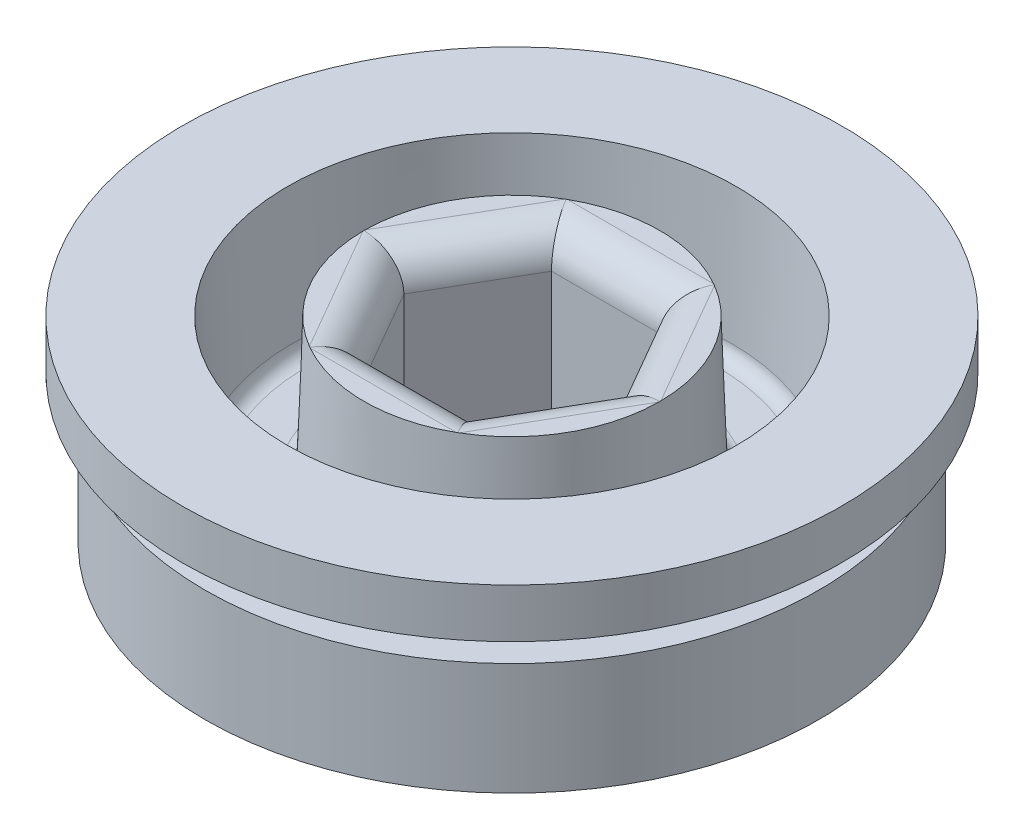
from build123d import *

# Parameters (mm, degrees)
BLANK_BEFORE_THREAD_DEPTH      = 1.778
BLANK_BEFORE_THREAD_DEPTH_BACK = 5.334
SKETCH1_R                      = 11.1125
SKETCH4_R                      = 11.938
HEAD_DEPTH                     = 1.778
RECESS_START                   = -1.27
SKETCH5_R                      = 11.938
SKETCH5_R_2                    = 10.1346
RECESS_UNDER_HEAD_DEPTH        = 1.27
FILL_START                     = 1.27
SKETCH8_R                      = 10.1346
FILL_IN_RECESS_DEPTH           = 1.27
HEX_THRU_DEPTH                 = 19.319722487
FILLET_ON_HEX_R                = 1.27
SKETCH7_R                      = 8.128
SKETCH7_R_2                    = 5.3594
SPRING_RECESS_DEPTH            = 5.334
SPRING_RECESS_DRAFT            = -2
FILLET1_R                      = 0.508


with BuildPart() as part:
    # Sketch1 → Blank Before Thread (new, two sides: drawn at the far end of the back side and taken through both)
    with BuildSketch(Plane(origin=(0, 0, 0), x_dir=(1, 0, 0), z_dir=(0, 1, 0)).offset(-BLANK_BEFORE_THREAD_DEPTH_BACK)):
        with Locations(Location((0, 0, 0), (0, 0, 270))):
            Circle(SKETCH1_R)
    extrude(amount=BLANK_BEFORE_THREAD_DEPTH + BLANK_BEFORE_THREAD_DEPTH_BACK)

    # Sketch4 → Head (add)
    with BuildSketch(Plane(origin=(0, 0, 0), x_dir=(1, 0, 0), z_dir=(0, 1, 0))):
        with Locations(Location((0, 0, 0), (0, 0, 270))):
            Circle(SKETCH4_R)
    extrude(amount=HEAD_DEPTH)

    # Sketch5 → Recess Under Head (cut)
    with BuildSketch(Plane(origin=(0, 0, 0), x_dir=(1, 0, 0), z_dir=(0, 1, 0)).offset(RECESS_START)):
        with Locations(Location((0, 0, 0), (0, 0, 270))):
            Circle(SKETCH5_R)
        with Locations(Location((0, 0, 0), (0, 0, 270))):
            Circle(SKETCH5_R_2, mode=Mode.SUBTRACT)
    extrude(amount=RECESS_UNDER_HEAD_DEPTH, mode=Mode.SUBTRACT)

    # Sketch8 → Fill in Recess (add)
    with BuildSketch(Plane.XZ.offset(FILL_START)):
        with Locations(Location((0, 0, 0), (0, 0, 90))):
            Circle(SKETCH8_R)
    extrude(amount=-FILL_IN_RECESS_DEPTH)

    # Sketch6 → Hex Thru (cut, through all)
    with BuildSketch(Plane(origin=(0, 1.778, 0), x_dir=(-1, 0, 0), z_dir=(0, 1, 0))):
        Polygon((1.957737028, -3.3909), (-1.957737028, -3.3909), (-3.915474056, 0), (-1.957737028, 3.3909), (1.957737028, 3.3909), (3.915474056, 0), align=None)
    extrude(amount=-HEX_THRU_DEPTH, mode=Mode.SUBTRACT)

    # Fillet on Hex
    fillet_on_hex_edges = [part.edges().sort_by_distance(p)[0] for p in [
        (2.936605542, 1.778, -1.69545),
        (-2.936605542, 1.778, 1.69545),
        (0, 1.778, -3.3909),
        (-2.936605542, 1.778, -1.69545),
        (0, 1.778, 3.3909),
        (2.936605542, 1.778, 1.69545),
    ]]
    fillet(fillet_on_hex_edges, radius=FILLET_ON_HEX_R)


with BuildPart() as spring_recess_tool:
    # Sketch7 → Spring Recess (with draft: the straight prism first)
    with BuildSketch(Plane(origin=(0, 1.778, 0), x_dir=(-1, 0, 0), z_dir=(0, 1, 0))):
        Circle(SKETCH7_R)
        Circle(SKETCH7_R_2, mode=Mode.SUBTRACT)
    extrude(amount=-SPRING_RECESS_DEPTH)
    # Spring Recess: the draft: its side faces are tilted about the plane it starts from
    spring_recess_sides = [spring_recess_tool.faces().sort_by_distance(p)[0] for p in [
        (8.128, -0.889, 0),
        (5.3594, -0.889, 0),
    ]]
    draft(spring_recess_sides, Plane(origin=(0, 1.778, 0), x_dir=(-1, 0, 0), z_dir=(0, 1, 0)), SPRING_RECESS_DRAFT)


with BuildPart() as part_1:
    add(part.part)

    # Spring Recess: cut by spring_recess_tool
    add(spring_recess_tool.part, mode=Mode.SUBTRACT)

    # Fillet1
    fillet1_edges = [part_1.edges().sort_by_distance(p)[0] for p in [
        (7.941732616, -3.556, 0),
        (5.545667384, -3.556, 0),
    ]]
    fillet(fillet1_edges, radius=FILLET1_R)


solid = part_1.part
